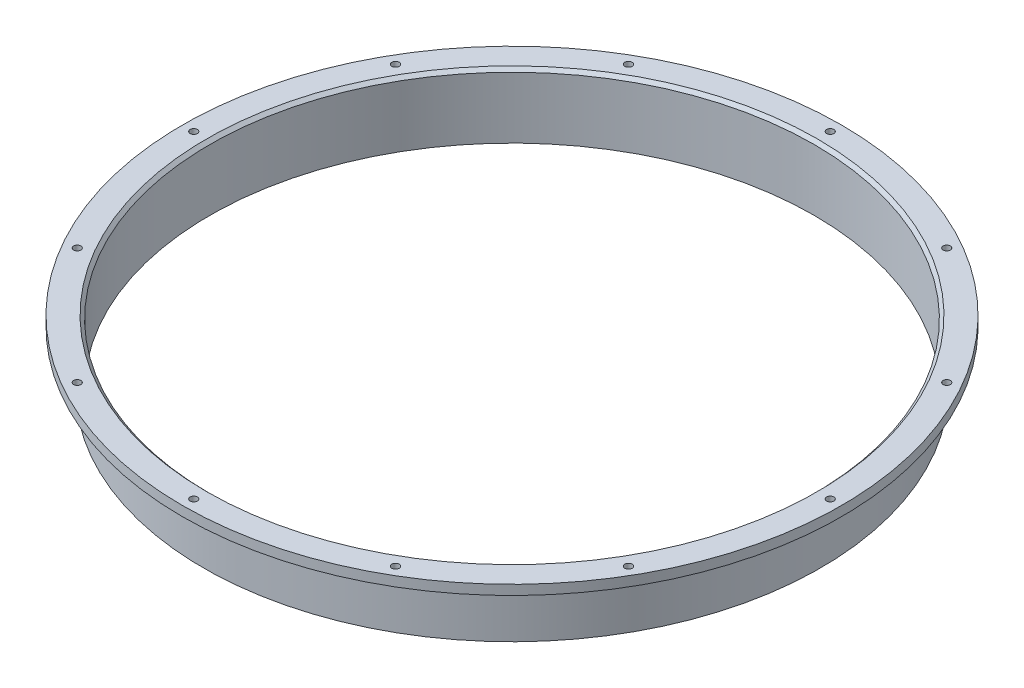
ISO-10303-21;
HEADER;
FILE_DESCRIPTION(('STEP AP214'),'2;1');
FILE_NAME('part.step','',(''),(''),'','','');
FILE_SCHEMA(('AUTOMOTIVE_DESIGN { 1 0 10303 214 1 1 1 1 }'));
ENDSEC;
DATA;
#1=APPLICATION_CONTEXT('core data for automotive mechanical design processes');
#2=APPLICATION_PROTOCOL_DEFINITION('international standard','automotive_design',2000,#1);
#3=PRODUCT_CONTEXT('',#1,'mechanical');
#4=PRODUCT('Part','Part','',(#3));
#5=PRODUCT_RELATED_PRODUCT_CATEGORY('part','',(#4));
#6=PRODUCT_DEFINITION_FORMATION('','',#4);
#7=PRODUCT_DEFINITION_CONTEXT('part definition',#1,'design');
#8=PRODUCT_DEFINITION('design','',#6,#7);
#9=PRODUCT_DEFINITION_SHAPE('','',#8);
#10=(LENGTH_UNIT() NAMED_UNIT(*) SI_UNIT(.MILLI.,.METRE.));
#11=(NAMED_UNIT(*) PLANE_ANGLE_UNIT() SI_UNIT($,.RADIAN.));
#12=(NAMED_UNIT(*) SI_UNIT($,.STERADIAN.) SOLID_ANGLE_UNIT());
#13=UNCERTAINTY_MEASURE_WITH_UNIT(LENGTH_MEASURE(1.E-05),#10,'distance_accuracy_value','');
#14=(GEOMETRIC_REPRESENTATION_CONTEXT(3) GLOBAL_UNCERTAINTY_ASSIGNED_CONTEXT((#13)) GLOBAL_UNIT_ASSIGNED_CONTEXT((#10,
#11,#12)) REPRESENTATION_CONTEXT('',''));
#15=CARTESIAN_POINT('',(0.,0.,0.));
#16=DIRECTION('',(0.,0.,1.));
#17=DIRECTION('',(1.,0.,0.));
#18=AXIS2_PLACEMENT_3D('',#15,#16,#17);
#19=CARTESIAN_POINT('',(0.,-63.5,0.));
#20=DIRECTION('',(0.,1.,0.));
#21=DIRECTION('',(0.,0.,1.));
#22=AXIS2_PLACEMENT_3D('',#19,#20,#21);
#23=CYLINDRICAL_SURFACE('',#22,323.85);
#24=CARTESIAN_POINT('',(0.,0.,0.));
#25=DIRECTION('',(0.,1.,0.));
#26=DIRECTION('',(0.,0.,1.));
#27=AXIS2_PLACEMENT_3D('',#24,#25,#26);
#28=CIRCLE('',#27,323.85);
#29=CARTESIAN_POINT('',(0.,0.,323.85));
#30=VERTEX_POINT('',#29);
#31=EDGE_CURVE('E39',#30,#30,#28,.T.);
#32=ORIENTED_EDGE('',*,*,#31,.F.);
#33=EDGE_LOOP('',(#32));
#34=FACE_BOUND('',#33,.T.);
#35=CARTESIAN_POINT('',(0.,-9.52500000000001,0.));
#36=DIRECTION('',(0.,-1.,0.));
#37=DIRECTION('',(0.,0.,-1.));
#38=AXIS2_PLACEMENT_3D('',#35,#36,#37);
#39=CIRCLE('',#38,323.85);
#40=CARTESIAN_POINT('',(0.,-9.52500000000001,-323.85));
#41=VERTEX_POINT('',#40);
#42=EDGE_CURVE('E95',#41,#41,#39,.F.);
#43=ORIENTED_EDGE('',*,*,#42,.T.);
#44=EDGE_LOOP('',(#43));
#45=FACE_BOUND('',#44,.T.);
#46=ADVANCED_FACE('F29',(#34,#45),#23,.T.);
#47=CARTESIAN_POINT('',(0.,-63.5,0.));
#48=DIRECTION('',(0.,1.,0.));
#49=DIRECTION('',(0.,0.,1.));
#50=AXIS2_PLACEMENT_3D('',#47,#48,#49);
#51=PLANE('',#50);
#52=CARTESIAN_POINT('',(0.,-63.5,0.));
#53=DIRECTION('',(0.,1.,0.));
#54=DIRECTION('',(0.,0.,1.));
#55=AXIS2_PLACEMENT_3D('',#52,#53,#54);
#56=CIRCLE('',#55,296.9895);
#57=CARTESIAN_POINT('',(0.,-63.5,296.9895));
#58=VERTEX_POINT('',#57);
#59=EDGE_CURVE('E43',#58,#58,#56,.T.);
#60=ORIENTED_EDGE('',*,*,#59,.T.);
#61=EDGE_LOOP('',(#60));
#62=FACE_BOUND('',#61,.T.);
#63=CARTESIAN_POINT('',(0.,-63.5,0.));
#64=DIRECTION('',(0.,-1.,0.));
#65=DIRECTION('',(0.,0.,-1.));
#66=AXIS2_PLACEMENT_3D('',#63,#64,#65);
#67=CIRCLE('',#66,303.2125);
#68=CARTESIAN_POINT('',(0.,-63.5,-303.2125));
#69=VERTEX_POINT('',#68);
#70=EDGE_CURVE('E94',#69,#69,#67,.T.);
#71=ORIENTED_EDGE('',*,*,#70,.T.);
#72=EDGE_LOOP('',(#71));
#73=FACE_BOUND('',#72,.T.);
#74=ADVANCED_FACE('F136',(#62,#73),#51,.F.);
#75=CARTESIAN_POINT('',(0.,0.,0.));
#76=DIRECTION('',(0.,1.,0.));
#77=DIRECTION('',(0.,0.,1.));
#78=AXIS2_PLACEMENT_3D('',#75,#76,#77);
#79=PLANE('',#78);
#80=CARTESIAN_POINT('',(0.,0.,0.));
#81=DIRECTION('',(0.,1.,0.));
#82=DIRECTION('',(0.,0.,1.));
#83=AXIS2_PLACEMENT_3D('',#80,#81,#82);
#84=CIRCLE('',#83,300.1645);
#85=CARTESIAN_POINT('',(0.,0.,300.1645));
#86=VERTEX_POINT('',#85);
#87=EDGE_CURVE('E11',#86,#86,#84,.F.);
#88=ORIENTED_EDGE('',*,*,#87,.T.);
#89=EDGE_LOOP('',(#88));
#90=FACE_BOUND('',#89,.T.);
#91=CARTESIAN_POINT('',(156.362399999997,0.,-270.82762119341));
#92=DIRECTION('',(0.,1.,0.));
#93=DIRECTION('',(-0.499999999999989,0.,0.866025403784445));
#94=AXIS2_PLACEMENT_3D('',#91,#92,#93);
#95=CIRCLE('',#94,3.56870000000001);
#96=CARTESIAN_POINT('',(154.578049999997,0.,-267.737036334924));
#97=VERTEX_POINT('',#96);
#98=EDGE_CURVE('E50',#97,#97,#95,.T.);
#99=ORIENTED_EDGE('',*,*,#98,.F.);
#100=EDGE_LOOP('',(#99));
#101=FACE_BOUND('',#100,.T.);
#102=CARTESIAN_POINT('',(270.827621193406,0.,-156.362400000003));
#103=DIRECTION('',(0.,1.,0.));
#104=DIRECTION('',(-0.866025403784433,0.,0.50000000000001));
#105=AXIS2_PLACEMENT_3D('',#102,#103,#104);
#106=CIRCLE('',#105,3.56870000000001);
#107=CARTESIAN_POINT('',(267.73703633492,0.,-154.578050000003));
#108=VERTEX_POINT('',#107);
#109=EDGE_CURVE('E49',#108,#108,#106,.T.);
#110=ORIENTED_EDGE('',*,*,#109,.F.);
#111=EDGE_LOOP('',(#110));
#112=FACE_BOUND('',#111,.T.);
#113=CARTESIAN_POINT('',(312.7248,0.,-3.27562030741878E-12));
#114=DIRECTION('',(0.,1.,0.));
#115=DIRECTION('',(-1.,0.,0.));
#116=AXIS2_PLACEMENT_3D('',#113,#114,#115);
#117=CIRCLE('',#116,3.56870000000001);
#118=CARTESIAN_POINT('',(309.1561,0.,-3.2382401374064E-12));
#119=VERTEX_POINT('',#118);
#120=EDGE_CURVE('E54',#119,#119,#117,.T.);
#121=ORIENTED_EDGE('',*,*,#120,.F.);
#122=EDGE_LOOP('',(#121));
#123=FACE_BOUND('',#122,.T.);
#124=CARTESIAN_POINT('',(270.827621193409,0.,156.362399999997));
#125=DIRECTION('',(0.,1.,0.));
#126=DIRECTION('',(-0.866025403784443,0.,-0.499999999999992));
#127=AXIS2_PLACEMENT_3D('',#124,#125,#126);
#128=CIRCLE('',#127,3.56870000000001);
#129=CARTESIAN_POINT('',(267.737036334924,0.,154.578049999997));
#130=VERTEX_POINT('',#129);
#131=EDGE_CURVE('E58',#130,#130,#128,.T.);
#132=ORIENTED_EDGE('',*,*,#131,.F.);
#133=EDGE_LOOP('',(#132));
#134=FACE_BOUND('',#133,.T.);
#135=CARTESIAN_POINT('',(156.362400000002,0.,270.827621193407));
#136=DIRECTION('',(0.,1.,0.));
#137=DIRECTION('',(-0.500000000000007,0.,-0.866025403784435));
#138=AXIS2_PLACEMENT_3D('',#135,#136,#137);
#139=CIRCLE('',#138,3.56870000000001);
#140=CARTESIAN_POINT('',(154.578050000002,0.,267.737036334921));
#141=VERTEX_POINT('',#140);
#142=EDGE_CURVE('E62',#141,#141,#139,.T.);
#143=ORIENTED_EDGE('',*,*,#142,.F.);
#144=EDGE_LOOP('',(#143));
#145=FACE_BOUND('',#144,.T.);
#146=CARTESIAN_POINT('',(2.18374687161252E-12,0.,312.7248));
#147=DIRECTION('',(0.,1.,0.));
#148=DIRECTION('',(0.,0.,-1.));
#149=AXIS2_PLACEMENT_3D('',#146,#147,#148);
#150=CIRCLE('',#149,3.56870000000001);
#151=CARTESIAN_POINT('',(2.15882675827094E-12,0.,309.1561));
#152=VERTEX_POINT('',#151);
#153=EDGE_CURVE('E66',#152,#152,#150,.T.);
#154=ORIENTED_EDGE('',*,*,#153,.F.);
#155=EDGE_LOOP('',(#154));
#156=FACE_BOUND('',#155,.T.);
#157=CARTESIAN_POINT('',(-156.362399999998,0.,270.827621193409));
#158=DIRECTION('',(0.,1.,0.));
#159=DIRECTION('',(0.499999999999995,0.,-0.866025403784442));
#160=AXIS2_PLACEMENT_3D('',#157,#158,#159);
#161=CIRCLE('',#160,3.56870000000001);
#162=CARTESIAN_POINT('',(-154.578049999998,0.,267.737036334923));
#163=VERTEX_POINT('',#162);
#164=EDGE_CURVE('E70',#163,#163,#161,.T.);
#165=ORIENTED_EDGE('',*,*,#164,.F.);
#166=EDGE_LOOP('',(#165));
#167=FACE_BOUND('',#166,.T.);
#168=CARTESIAN_POINT('',(-270.827621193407,0.,156.362400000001));
#169=DIRECTION('',(0.,1.,0.));
#170=DIRECTION('',(0.866025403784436,0.,-0.500000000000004));
#171=AXIS2_PLACEMENT_3D('',#168,#169,#170);
#172=CIRCLE('',#171,3.56870000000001);
#173=CARTESIAN_POINT('',(-267.737036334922,0.,154.578050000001));
#174=VERTEX_POINT('',#173);
#175=EDGE_CURVE('E74',#174,#174,#172,.T.);
#176=ORIENTED_EDGE('',*,*,#175,.F.);
#177=EDGE_LOOP('',(#176));
#178=FACE_BOUND('',#177,.T.);
#179=CARTESIAN_POINT('',(-312.7248,0.,1.09187343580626E-12));
#180=DIRECTION('',(0.,1.,0.));
#181=DIRECTION('',(1.,0.,0.));
#182=AXIS2_PLACEMENT_3D('',#179,#180,#181);
#183=CIRCLE('',#182,3.56870000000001);
#184=CARTESIAN_POINT('',(-309.1561,0.,1.07941337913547E-12));
#185=VERTEX_POINT('',#184);
#186=EDGE_CURVE('E78',#185,#185,#183,.T.);
#187=ORIENTED_EDGE('',*,*,#186,.F.);
#188=EDGE_LOOP('',(#187));
#189=FACE_BOUND('',#188,.T.);
#190=CARTESIAN_POINT('',(-270.827621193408,0.,-156.362399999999));
#191=DIRECTION('',(0.,1.,0.));
#192=DIRECTION('',(0.86602540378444,0.,0.499999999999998));
#193=AXIS2_PLACEMENT_3D('',#190,#191,#192);
#194=CIRCLE('',#193,3.56870000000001);
#195=CARTESIAN_POINT('',(-267.737036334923,0.,-154.578049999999));
#196=VERTEX_POINT('',#195);
#197=EDGE_CURVE('E82',#196,#196,#194,.T.);
#198=ORIENTED_EDGE('',*,*,#197,.F.);
#199=EDGE_LOOP('',(#198));
#200=FACE_BOUND('',#199,.T.);
#201=CARTESIAN_POINT('',(-156.3624,0.,-270.827621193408));
#202=DIRECTION('',(0.,1.,0.));
#203=DIRECTION('',(0.500000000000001,0.,0.866025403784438));
#204=AXIS2_PLACEMENT_3D('',#201,#202,#203);
#205=CIRCLE('',#204,3.56870000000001);
#206=CARTESIAN_POINT('',(-154.57805,0.,-267.737036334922));
#207=VERTEX_POINT('',#206);
#208=EDGE_CURVE('E86',#207,#207,#205,.T.);
#209=ORIENTED_EDGE('',*,*,#208,.F.);
#210=EDGE_LOOP('',(#209));
#211=FACE_BOUND('',#210,.T.);
#212=CARTESIAN_POINT('',(0.,0.,-312.7248));
#213=DIRECTION('',(0.,1.,0.));
#214=DIRECTION('',(0.,0.,1.));
#215=AXIS2_PLACEMENT_3D('',#212,#213,#214);
#216=CIRCLE('',#215,3.56870000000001);
#217=CARTESIAN_POINT('',(0.,0.,-309.1561));
#218=VERTEX_POINT('',#217);
#219=EDGE_CURVE('E90',#218,#218,#216,.T.);
#220=ORIENTED_EDGE('',*,*,#219,.F.);
#221=EDGE_LOOP('',(#220));
#222=FACE_BOUND('',#221,.T.);
#223=ORIENTED_EDGE('',*,*,#31,.T.);
#224=EDGE_LOOP('',(#223));
#225=FACE_BOUND('',#224,.T.);
#226=ADVANCED_FACE('F132',(#90,#101,#112,#123,#134,#145,#156,#167,#178,#189,#200,#211,#222,
#225),#79,.T.);
#227=CARTESIAN_POINT('',(0.,-63.5,0.));
#228=DIRECTION('',(0.,1.,0.));
#229=DIRECTION('',(0.,0.,1.));
#230=AXIS2_PLACEMENT_3D('',#227,#228,#229);
#231=CYLINDRICAL_SURFACE('',#230,296.9895);
#232=CARTESIAN_POINT('',(0.,-3.17499999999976,0.));
#233=DIRECTION('',(0.,1.,0.));
#234=DIRECTION('',(0.,0.,1.));
#235=AXIS2_PLACEMENT_3D('',#232,#233,#234);
#236=CIRCLE('',#235,296.9895);
#237=CARTESIAN_POINT('',(0.,-3.17499999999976,296.9895));
#238=VERTEX_POINT('',#237);
#239=EDGE_CURVE('E35',#238,#238,#236,.T.);
#240=ORIENTED_EDGE('',*,*,#239,.T.);
#241=EDGE_LOOP('',(#240));
#242=FACE_BOUND('',#241,.T.);
#243=ORIENTED_EDGE('',*,*,#59,.F.);
#244=EDGE_LOOP('',(#243));
#245=FACE_BOUND('',#244,.T.);
#246=ADVANCED_FACE('F135',(#242,#245),#231,.F.);
#247=CARTESIAN_POINT('',(0.,-9.52500000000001,0.));
#248=DIRECTION('',(0.,-1.,0.));
#249=DIRECTION('',(0.,0.,-1.));
#250=AXIS2_PLACEMENT_3D('',#247,#248,#249);
#251=PLANE('',#250);
#252=CARTESIAN_POINT('',(156.362399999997,-9.52500000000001,-270.82762119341));
#253=DIRECTION('',(0.,-1.,0.));
#254=DIRECTION('',(0.,0.,-1.));
#255=AXIS2_PLACEMENT_3D('',#252,#253,#254);
#256=CIRCLE('',#255,3.56870000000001);
#257=CARTESIAN_POINT('',(156.362399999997,-9.52500000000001,-274.39632119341));
#258=VERTEX_POINT('',#257);
#259=EDGE_CURVE('E46',#258,#258,#256,.T.);
#260=ORIENTED_EDGE('',*,*,#259,.F.);
#261=EDGE_LOOP('',(#260));
#262=FACE_BOUND('',#261,.T.);
#263=CARTESIAN_POINT('',(270.827621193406,-9.52500000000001,-156.362400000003));
#264=DIRECTION('',(0.,-1.,0.));
#265=DIRECTION('',(0.,0.,-1.));
#266=AXIS2_PLACEMENT_3D('',#263,#264,#265);
#267=CIRCLE('',#266,3.56870000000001);
#268=CARTESIAN_POINT('',(270.827621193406,-9.52500000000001,-159.931100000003));
#269=VERTEX_POINT('',#268);
#270=EDGE_CURVE('E51',#269,#269,#267,.T.);
#271=ORIENTED_EDGE('',*,*,#270,.F.);
#272=EDGE_LOOP('',(#271));
#273=FACE_BOUND('',#272,.T.);
#274=CARTESIAN_POINT('',(312.7248,-9.52500000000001,-3.27562030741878E-12));
#275=DIRECTION('',(0.,-1.,0.));
#276=DIRECTION('',(0.,0.,-1.));
#277=AXIS2_PLACEMENT_3D('',#274,#275,#276);
#278=CIRCLE('',#277,3.56870000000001);
#279=CARTESIAN_POINT('',(312.7248,-9.52500000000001,-3.56870000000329));
#280=VERTEX_POINT('',#279);
#281=EDGE_CURVE('E55',#280,#280,#278,.T.);
#282=ORIENTED_EDGE('',*,*,#281,.F.);
#283=EDGE_LOOP('',(#282));
#284=FACE_BOUND('',#283,.T.);
#285=CARTESIAN_POINT('',(270.827621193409,-9.52500000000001,156.362399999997));
#286=DIRECTION('',(0.,-1.,0.));
#287=DIRECTION('',(0.,0.,-1.));
#288=AXIS2_PLACEMENT_3D('',#285,#286,#287);
#289=CIRCLE('',#288,3.56870000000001);
#290=CARTESIAN_POINT('',(270.827621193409,-9.52500000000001,152.793699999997));
#291=VERTEX_POINT('',#290);
#292=EDGE_CURVE('E59',#291,#291,#289,.T.);
#293=ORIENTED_EDGE('',*,*,#292,.F.);
#294=EDGE_LOOP('',(#293));
#295=FACE_BOUND('',#294,.T.);
#296=CARTESIAN_POINT('',(156.362400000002,-9.52500000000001,270.827621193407));
#297=DIRECTION('',(0.,-1.,0.));
#298=DIRECTION('',(0.,0.,-1.));
#299=AXIS2_PLACEMENT_3D('',#296,#297,#298);
#300=CIRCLE('',#299,3.56870000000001);
#301=CARTESIAN_POINT('',(156.362400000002,-9.52500000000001,267.258921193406));
#302=VERTEX_POINT('',#301);
#303=EDGE_CURVE('E63',#302,#302,#300,.T.);
#304=ORIENTED_EDGE('',*,*,#303,.F.);
#305=EDGE_LOOP('',(#304));
#306=FACE_BOUND('',#305,.T.);
#307=CARTESIAN_POINT('',(2.18374687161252E-12,-9.52500000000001,312.7248));
#308=DIRECTION('',(0.,-1.,0.));
#309=DIRECTION('',(0.,0.,-1.));
#310=AXIS2_PLACEMENT_3D('',#307,#308,#309);
#311=CIRCLE('',#310,3.56870000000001);
#312=CARTESIAN_POINT('',(2.18374687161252E-12,-9.52500000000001,309.1561));
#313=VERTEX_POINT('',#312);
#314=EDGE_CURVE('E67',#313,#313,#311,.T.);
#315=ORIENTED_EDGE('',*,*,#314,.F.);
#316=EDGE_LOOP('',(#315));
#317=FACE_BOUND('',#316,.T.);
#318=CARTESIAN_POINT('',(-156.362399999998,-9.52500000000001,270.827621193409));
#319=DIRECTION('',(0.,-1.,0.));
#320=DIRECTION('',(0.,0.,-1.));
#321=AXIS2_PLACEMENT_3D('',#318,#319,#320);
#322=CIRCLE('',#321,3.56870000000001);
#323=CARTESIAN_POINT('',(-156.362399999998,-9.52500000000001,267.258921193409));
#324=VERTEX_POINT('',#323);
#325=EDGE_CURVE('E71',#324,#324,#322,.T.);
#326=ORIENTED_EDGE('',*,*,#325,.F.);
#327=EDGE_LOOP('',(#326));
#328=FACE_BOUND('',#327,.T.);
#329=CARTESIAN_POINT('',(-270.827621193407,-9.52500000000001,156.362400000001));
#330=DIRECTION('',(0.,-1.,0.));
#331=DIRECTION('',(0.,0.,-1.));
#332=AXIS2_PLACEMENT_3D('',#329,#330,#331);
#333=CIRCLE('',#332,3.56870000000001);
#334=CARTESIAN_POINT('',(-270.827621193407,-9.52500000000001,152.793700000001));
#335=VERTEX_POINT('',#334);
#336=EDGE_CURVE('E75',#335,#335,#333,.T.);
#337=ORIENTED_EDGE('',*,*,#336,.F.);
#338=EDGE_LOOP('',(#337));
#339=FACE_BOUND('',#338,.T.);
#340=CARTESIAN_POINT('',(-312.7248,-9.52500000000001,1.09187343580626E-12));
#341=DIRECTION('',(0.,-1.,0.));
#342=DIRECTION('',(0.,0.,-1.));
#343=AXIS2_PLACEMENT_3D('',#340,#341,#342);
#344=CIRCLE('',#343,3.56870000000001);
#345=CARTESIAN_POINT('',(-312.7248,-9.52500000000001,-3.56869999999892));
#346=VERTEX_POINT('',#345);
#347=EDGE_CURVE('E79',#346,#346,#344,.T.);
#348=ORIENTED_EDGE('',*,*,#347,.F.);
#349=EDGE_LOOP('',(#348));
#350=FACE_BOUND('',#349,.T.);
#351=CARTESIAN_POINT('',(-270.827621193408,-9.52500000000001,-156.362399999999));
#352=DIRECTION('',(0.,-1.,0.));
#353=DIRECTION('',(0.,0.,-1.));
#354=AXIS2_PLACEMENT_3D('',#351,#352,#353);
#355=CIRCLE('',#354,3.56870000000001);
#356=CARTESIAN_POINT('',(-270.827621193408,-9.52500000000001,-159.931099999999));
#357=VERTEX_POINT('',#356);
#358=EDGE_CURVE('E83',#357,#357,#355,.T.);
#359=ORIENTED_EDGE('',*,*,#358,.F.);
#360=EDGE_LOOP('',(#359));
#361=FACE_BOUND('',#360,.T.);
#362=CARTESIAN_POINT('',(-156.3624,-9.52500000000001,-270.827621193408));
#363=DIRECTION('',(0.,-1.,0.));
#364=DIRECTION('',(0.,0.,-1.));
#365=AXIS2_PLACEMENT_3D('',#362,#363,#364);
#366=CIRCLE('',#365,3.56870000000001);
#367=CARTESIAN_POINT('',(-156.3624,-9.52500000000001,-274.396321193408));
#368=VERTEX_POINT('',#367);
#369=EDGE_CURVE('E87',#368,#368,#366,.T.);
#370=ORIENTED_EDGE('',*,*,#369,.F.);
#371=EDGE_LOOP('',(#370));
#372=FACE_BOUND('',#371,.T.);
#373=CARTESIAN_POINT('',(0.,-9.52500000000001,-312.7248));
#374=DIRECTION('',(0.,-1.,0.));
#375=DIRECTION('',(0.,0.,-1.));
#376=AXIS2_PLACEMENT_3D('',#373,#374,#375);
#377=CIRCLE('',#376,3.56870000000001);
#378=CARTESIAN_POINT('',(0.,-9.52500000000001,-316.2935));
#379=VERTEX_POINT('',#378);
#380=EDGE_CURVE('E91',#379,#379,#377,.T.);
#381=ORIENTED_EDGE('',*,*,#380,.F.);
#382=EDGE_LOOP('',(#381));
#383=FACE_BOUND('',#382,.T.);
#384=ORIENTED_EDGE('',*,*,#42,.F.);
#385=EDGE_LOOP('',(#384));
#386=FACE_BOUND('',#385,.T.);
#387=CARTESIAN_POINT('',(0.,-9.52500000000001,0.));
#388=DIRECTION('',(0.,-1.,0.));
#389=DIRECTION('',(0.,0.,-1.));
#390=AXIS2_PLACEMENT_3D('',#387,#388,#389);
#391=CIRCLE('',#390,303.2125);
#392=CARTESIAN_POINT('',(0.,-9.52500000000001,-303.2125));
#393=VERTEX_POINT('',#392);
#394=EDGE_CURVE('E97',#393,#393,#391,.T.);
#395=ORIENTED_EDGE('',*,*,#394,.F.);
#396=EDGE_LOOP('',(#395));
#397=FACE_BOUND('',#396,.T.);
#398=ADVANCED_FACE('F166',(#262,#273,#284,#295,#306,#317,#328,#339,#350,#361,#372,#383,#386,
#397),#251,.T.);
#399=CARTESIAN_POINT('',(0.,-9.52500000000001,0.));
#400=DIRECTION('',(0.,-1.,0.));
#401=DIRECTION('',(0.,0.,-1.));
#402=AXIS2_PLACEMENT_3D('',#399,#400,#401);
#403=CYLINDRICAL_SURFACE('',#402,303.2125);
#404=ORIENTED_EDGE('',*,*,#394,.T.);
#405=EDGE_LOOP('',(#404));
#406=FACE_BOUND('',#405,.T.);
#407=ORIENTED_EDGE('',*,*,#70,.F.);
#408=EDGE_LOOP('',(#407));
#409=FACE_BOUND('',#408,.T.);
#410=ADVANCED_FACE('F169',(#406,#409),#403,.T.);
#411=CARTESIAN_POINT('',(0.,-63.5,-312.7248));
#412=DIRECTION('',(0.,1.,0.));
#413=DIRECTION('',(0.,0.,1.));
#414=AXIS2_PLACEMENT_3D('',#411,#412,#413);
#415=CYLINDRICAL_SURFACE('',#414,3.56870000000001);
#416=ORIENTED_EDGE('',*,*,#380,.T.);
#417=EDGE_LOOP('',(#416));
#418=FACE_BOUND('',#417,.T.);
#419=ORIENTED_EDGE('',*,*,#219,.T.);
#420=EDGE_LOOP('',(#419));
#421=FACE_BOUND('',#420,.T.);
#422=ADVANCED_FACE('F176',(#418,#421),#415,.F.);
#423=CARTESIAN_POINT('',(-156.3624,-63.5,-270.827621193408));
#424=DIRECTION('',(0.,1.,0.));
#425=DIRECTION('',(0.,0.,1.));
#426=AXIS2_PLACEMENT_3D('',#423,#424,#425);
#427=CYLINDRICAL_SURFACE('',#426,3.56870000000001);
#428=ORIENTED_EDGE('',*,*,#369,.T.);
#429=EDGE_LOOP('',(#428));
#430=FACE_BOUND('',#429,.T.);
#431=ORIENTED_EDGE('',*,*,#208,.T.);
#432=EDGE_LOOP('',(#431));
#433=FACE_BOUND('',#432,.T.);
#434=ADVANCED_FACE('F189',(#430,#433),#427,.F.);
#435=CARTESIAN_POINT('',(-270.827621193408,-63.5,-156.362399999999));
#436=DIRECTION('',(0.,1.,0.));
#437=DIRECTION('',(0.,0.,1.));
#438=AXIS2_PLACEMENT_3D('',#435,#436,#437);
#439=CYLINDRICAL_SURFACE('',#438,3.56870000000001);
#440=ORIENTED_EDGE('',*,*,#358,.T.);
#441=EDGE_LOOP('',(#440));
#442=FACE_BOUND('',#441,.T.);
#443=ORIENTED_EDGE('',*,*,#197,.T.);
#444=EDGE_LOOP('',(#443));
#445=FACE_BOUND('',#444,.T.);
#446=ADVANCED_FACE('F193',(#442,#445),#439,.F.);
#447=CARTESIAN_POINT('',(-312.7248,-63.5,1.09187343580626E-12));
#448=DIRECTION('',(0.,1.,0.));
#449=DIRECTION('',(0.,0.,1.));
#450=AXIS2_PLACEMENT_3D('',#447,#448,#449);
#451=CYLINDRICAL_SURFACE('',#450,3.56870000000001);
#452=ORIENTED_EDGE('',*,*,#347,.T.);
#453=EDGE_LOOP('',(#452));
#454=FACE_BOUND('',#453,.T.);
#455=ORIENTED_EDGE('',*,*,#186,.T.);
#456=EDGE_LOOP('',(#455));
#457=FACE_BOUND('',#456,.T.);
#458=ADVANCED_FACE('F197',(#454,#457),#451,.F.);
#459=CARTESIAN_POINT('',(-270.827621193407,-63.5,156.362400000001));
#460=DIRECTION('',(0.,1.,0.));
#461=DIRECTION('',(0.,0.,1.));
#462=AXIS2_PLACEMENT_3D('',#459,#460,#461);
#463=CYLINDRICAL_SURFACE('',#462,3.56870000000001);
#464=ORIENTED_EDGE('',*,*,#336,.T.);
#465=EDGE_LOOP('',(#464));
#466=FACE_BOUND('',#465,.T.);
#467=ORIENTED_EDGE('',*,*,#175,.T.);
#468=EDGE_LOOP('',(#467));
#469=FACE_BOUND('',#468,.T.);
#470=ADVANCED_FACE('F201',(#466,#469),#463,.F.);
#471=CARTESIAN_POINT('',(-156.362399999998,-63.5,270.827621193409));
#472=DIRECTION('',(0.,1.,0.));
#473=DIRECTION('',(0.,0.,1.));
#474=AXIS2_PLACEMENT_3D('',#471,#472,#473);
#475=CYLINDRICAL_SURFACE('',#474,3.56870000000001);
#476=ORIENTED_EDGE('',*,*,#325,.T.);
#477=EDGE_LOOP('',(#476));
#478=FACE_BOUND('',#477,.T.);
#479=ORIENTED_EDGE('',*,*,#164,.T.);
#480=EDGE_LOOP('',(#479));
#481=FACE_BOUND('',#480,.T.);
#482=ADVANCED_FACE('F205',(#478,#481),#475,.F.);
#483=CARTESIAN_POINT('',(2.18374687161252E-12,-63.5,312.7248));
#484=DIRECTION('',(0.,1.,0.));
#485=DIRECTION('',(0.,0.,1.));
#486=AXIS2_PLACEMENT_3D('',#483,#484,#485);
#487=CYLINDRICAL_SURFACE('',#486,3.56870000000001);
#488=ORIENTED_EDGE('',*,*,#314,.T.);
#489=EDGE_LOOP('',(#488));
#490=FACE_BOUND('',#489,.T.);
#491=ORIENTED_EDGE('',*,*,#153,.T.);
#492=EDGE_LOOP('',(#491));
#493=FACE_BOUND('',#492,.T.);
#494=ADVANCED_FACE('F209',(#490,#493),#487,.F.);
#495=CARTESIAN_POINT('',(156.362400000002,-63.5,270.827621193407));
#496=DIRECTION('',(0.,1.,0.));
#497=DIRECTION('',(0.,0.,1.));
#498=AXIS2_PLACEMENT_3D('',#495,#496,#497);
#499=CYLINDRICAL_SURFACE('',#498,3.56870000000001);
#500=ORIENTED_EDGE('',*,*,#303,.T.);
#501=EDGE_LOOP('',(#500));
#502=FACE_BOUND('',#501,.T.);
#503=ORIENTED_EDGE('',*,*,#142,.T.);
#504=EDGE_LOOP('',(#503));
#505=FACE_BOUND('',#504,.T.);
#506=ADVANCED_FACE('F213',(#502,#505),#499,.F.);
#507=CARTESIAN_POINT('',(270.827621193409,-63.5,156.362399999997));
#508=DIRECTION('',(0.,1.,0.));
#509=DIRECTION('',(0.,0.,1.));
#510=AXIS2_PLACEMENT_3D('',#507,#508,#509);
#511=CYLINDRICAL_SURFACE('',#510,3.56870000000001);
#512=ORIENTED_EDGE('',*,*,#292,.T.);
#513=EDGE_LOOP('',(#512));
#514=FACE_BOUND('',#513,.T.);
#515=ORIENTED_EDGE('',*,*,#131,.T.);
#516=EDGE_LOOP('',(#515));
#517=FACE_BOUND('',#516,.T.);
#518=ADVANCED_FACE('F217',(#514,#517),#511,.F.);
#519=CARTESIAN_POINT('',(312.7248,-63.5,-3.27562030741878E-12));
#520=DIRECTION('',(0.,1.,0.));
#521=DIRECTION('',(0.,0.,1.));
#522=AXIS2_PLACEMENT_3D('',#519,#520,#521);
#523=CYLINDRICAL_SURFACE('',#522,3.56870000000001);
#524=ORIENTED_EDGE('',*,*,#281,.T.);
#525=EDGE_LOOP('',(#524));
#526=FACE_BOUND('',#525,.T.);
#527=ORIENTED_EDGE('',*,*,#120,.T.);
#528=EDGE_LOOP('',(#527));
#529=FACE_BOUND('',#528,.T.);
#530=ADVANCED_FACE('F221',(#526,#529),#523,.F.);
#531=CARTESIAN_POINT('',(270.827621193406,-63.5,-156.362400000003));
#532=DIRECTION('',(0.,1.,0.));
#533=DIRECTION('',(0.,0.,1.));
#534=AXIS2_PLACEMENT_3D('',#531,#532,#533);
#535=CYLINDRICAL_SURFACE('',#534,3.56870000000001);
#536=ORIENTED_EDGE('',*,*,#270,.T.);
#537=EDGE_LOOP('',(#536));
#538=FACE_BOUND('',#537,.T.);
#539=ORIENTED_EDGE('',*,*,#109,.T.);
#540=EDGE_LOOP('',(#539));
#541=FACE_BOUND('',#540,.T.);
#542=ADVANCED_FACE('F225',(#538,#541),#535,.F.);
#543=CARTESIAN_POINT('',(156.362399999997,-63.5,-270.82762119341));
#544=DIRECTION('',(0.,1.,0.));
#545=DIRECTION('',(0.,0.,1.));
#546=AXIS2_PLACEMENT_3D('',#543,#544,#545);
#547=CYLINDRICAL_SURFACE('',#546,3.56870000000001);
#548=ORIENTED_EDGE('',*,*,#259,.T.);
#549=EDGE_LOOP('',(#548));
#550=FACE_BOUND('',#549,.T.);
#551=ORIENTED_EDGE('',*,*,#98,.T.);
#552=EDGE_LOOP('',(#551));
#553=FACE_BOUND('',#552,.T.);
#554=ADVANCED_FACE('F130',(#550,#553),#547,.F.);
#555=CARTESIAN_POINT('',(0.,-3.17499999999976,0.));
#556=DIRECTION('',(0.,1.,0.));
#557=DIRECTION('',(0.,0.,1.));
#558=AXIS2_PLACEMENT_3D('',#555,#556,#557);
#559=CONICAL_SURFACE('',#558,296.9895,0.785398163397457);
#560=CARTESIAN_POINT('',(0.,0.,300.1645));
#561=CARTESIAN_POINT('',(0.,-0.0330729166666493,300.131427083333));
#562=CARTESIAN_POINT('',(0.,-0.0661458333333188,300.098354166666));
#563=CARTESIAN_POINT('',(0.,-0.132291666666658,300.032208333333));
#564=CARTESIAN_POINT('',(0.,-0.165364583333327,299.999135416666));
#565=CARTESIAN_POINT('',(0.,-0.231510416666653,299.932989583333));
#566=CARTESIAN_POINT('',(0.,-0.264583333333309,299.899916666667));
#567=CARTESIAN_POINT('',(0.,-0.330729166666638,299.833770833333));
#568=CARTESIAN_POINT('',(0.,-0.363802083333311,299.800697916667));
#569=CARTESIAN_POINT('',(0.,-0.429947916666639,299.734552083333));
#570=CARTESIAN_POINT('',(0.,-0.463020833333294,299.701479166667));
#571=CARTESIAN_POINT('',(0.,-0.529166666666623,299.635333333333));
#572=CARTESIAN_POINT('',(0.,-0.562239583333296,299.602260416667));
#573=CARTESIAN_POINT('',(0.,-0.628385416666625,299.536114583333));
#574=CARTESIAN_POINT('',(0.,-0.66145833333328,299.503041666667));
#575=CARTESIAN_POINT('',(0.,-0.727604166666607,299.436895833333));
#576=CARTESIAN_POINT('',(0.,-0.760677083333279,299.403822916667));
#577=CARTESIAN_POINT('',(0.,-0.826822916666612,299.337677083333));
#578=CARTESIAN_POINT('',(0.,-0.859895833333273,299.304604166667));
#579=CARTESIAN_POINT('',(0.,-0.926041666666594,299.238458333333));
#580=CARTESIAN_POINT('',(0.,-0.959114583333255,299.205385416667));
#581=CARTESIAN_POINT('',(0.,-1.02526041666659,299.139239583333));
#582=CARTESIAN_POINT('',(0.,-1.05833333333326,299.106166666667));
#583=CARTESIAN_POINT('',(0.,-1.12447916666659,299.040020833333));
#584=CARTESIAN_POINT('',(0.,-1.15755208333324,299.006947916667));
#585=CARTESIAN_POINT('',(0.,-1.22369791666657,298.940802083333));
#586=CARTESIAN_POINT('',(0.,-1.25677083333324,298.907729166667));
#587=CARTESIAN_POINT('',(0.,-1.32291666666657,298.841583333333));
#588=CARTESIAN_POINT('',(0.,-1.35598958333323,298.808510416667));
#589=CARTESIAN_POINT('',(0.,-1.42213541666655,298.742364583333));
#590=CARTESIAN_POINT('',(0.,-1.45520833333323,298.709291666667));
#591=CARTESIAN_POINT('',(0.,-1.52135416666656,298.643145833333));
#592=CARTESIAN_POINT('',(0.,-1.55442708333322,298.610072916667));
#593=CARTESIAN_POINT('',(0.,-1.62057291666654,298.543927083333));
#594=CARTESIAN_POINT('',(0.,-1.6536458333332,298.510854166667));
#595=CARTESIAN_POINT('',(0.,-1.71979166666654,298.444708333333));
#596=CARTESIAN_POINT('',(0.,-1.75286458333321,298.411635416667));
#597=CARTESIAN_POINT('',(0.,-1.81901041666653,298.345489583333));
#598=CARTESIAN_POINT('',(0.,-1.85208333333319,298.312416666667));
#599=CARTESIAN_POINT('',(0.,-1.91822916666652,298.246270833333));
#600=CARTESIAN_POINT('',(0.,-1.95130208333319,298.213197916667));
#601=CARTESIAN_POINT('',(0.,-2.01744791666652,298.147052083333));
#602=CARTESIAN_POINT('',(0.,-2.05052083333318,298.113979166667));
#603=CARTESIAN_POINT('',(0.,-2.1166666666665,298.047833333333));
#604=CARTESIAN_POINT('',(0.,-2.14973958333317,298.014760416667));
#605=CARTESIAN_POINT('',(0.,-2.21588541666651,297.948614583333));
#606=CARTESIAN_POINT('',(0.,-2.24895833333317,297.915541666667));
#607=CARTESIAN_POINT('',(0.,-2.31510416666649,297.849395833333));
#608=CARTESIAN_POINT('',(0.,-2.34817708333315,297.816322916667));
#609=CARTESIAN_POINT('',(0.,-2.41432291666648,297.750177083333));
#610=CARTESIAN_POINT('',(0.,-2.44739583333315,297.717104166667));
#611=CARTESIAN_POINT('',(0.,-2.51354166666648,297.650958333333));
#612=CARTESIAN_POINT('',(0.,-2.54661458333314,297.617885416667));
#613=CARTESIAN_POINT('',(0.,-2.61276041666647,297.551739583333));
#614=CARTESIAN_POINT('',(0.,-2.64583333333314,297.518666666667));
#615=CARTESIAN_POINT('',(0.,-2.71197916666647,297.452520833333));
#616=CARTESIAN_POINT('',(0.,-2.74505208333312,297.419447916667));
#617=CARTESIAN_POINT('',(0.,-2.81119791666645,297.353302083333));
#618=CARTESIAN_POINT('',(0.,-2.84427083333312,297.320229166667));
#619=CARTESIAN_POINT('',(0.,-2.91041666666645,297.254083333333));
#620=CARTESIAN_POINT('',(0.,-2.94348958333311,297.221010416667));
#621=CARTESIAN_POINT('',(0.,-3.00963541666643,297.154864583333));
#622=CARTESIAN_POINT('',(0.,-3.0427083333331,297.121791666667));
#623=CARTESIAN_POINT('',(0.,-3.10885416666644,297.055645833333));
#624=CARTESIAN_POINT('',(0.,-3.14192708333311,297.022572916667));
#625=CARTESIAN_POINT('',(0.,-3.17499999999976,296.9895));
#626=B_SPLINE_CURVE_WITH_KNOTS('',3,(#560,#561,#562,#563,#564,#565,#566,#567,#568,#569,#570,
#571,#572,#573,#574,#575,#576,#577,#578,#579,#580,#581,#582,#583,#584,#585,#586,#587,#588,#589,
#590,#591,#592,#593,#594,#595,#596,#597,#598,#599,#600,#601,#602,#603,#604,#605,#606,#607,#608,
#609,#610,#611,#612,#613,#614,#615,#616,#617,#618,#619,#620,#621,#622,#623,#624,#625),
.UNSPECIFIED.,.F.,.F.,(4,2,2,2,2,2,2,2,2,2,2,2,2,2,2,2,2,2,2,2,2,2,2,2,2,2,2,2,2,2,2,2,4),(0.,
0.140316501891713,0.280633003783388,0.420949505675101,0.561266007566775,0.701582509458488,
0.841899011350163,0.982215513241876,1.12253201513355,1.26284851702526,1.40316501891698,
1.54348152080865,1.68379802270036,1.82411452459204,1.96443102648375,2.10474752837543,
2.24506403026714,2.38538053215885,2.52569703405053,2.66601353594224,2.80633003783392,
2.94664653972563,3.0869630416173,3.22727954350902,3.36759604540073,3.5079125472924,
3.64822904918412,3.78854555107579,3.9288620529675,4.06917855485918,4.20949505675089,
4.34981155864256,4.49012806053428),.UNSPECIFIED.);
#627=EDGE_CURVE('BSEAM232',#86,#238,#626,.T.);
#628=ORIENTED_EDGE('',*,*,#87,.F.);
#629=ORIENTED_EDGE('',*,*,#239,.F.);
#630=ORIENTED_EDGE('',*,*,#627,.T.);
#631=ORIENTED_EDGE('',*,*,#627,.F.);
#632=EDGE_LOOP('',(#628,#630,#629,#631));
#633=FACE_BOUND('',#632,.T.);
#634=ADVANCED_FACE('F232',(#633),#559,.F.);
#635=CLOSED_SHELL('',(#46,#74,#226,#246,#398,#410,#422,#434,#446,#458,#470,#482,#494,#506,#518,
#530,#542,#554,#634));
#636=MANIFOLD_SOLID_BREP('B2',#635);
#637=ADVANCED_BREP_SHAPE_REPRESENTATION('',(#18,#636),#14);
#638=SHAPE_DEFINITION_REPRESENTATION(#9,#637);
ENDSEC;
END-ISO-10303-21;
